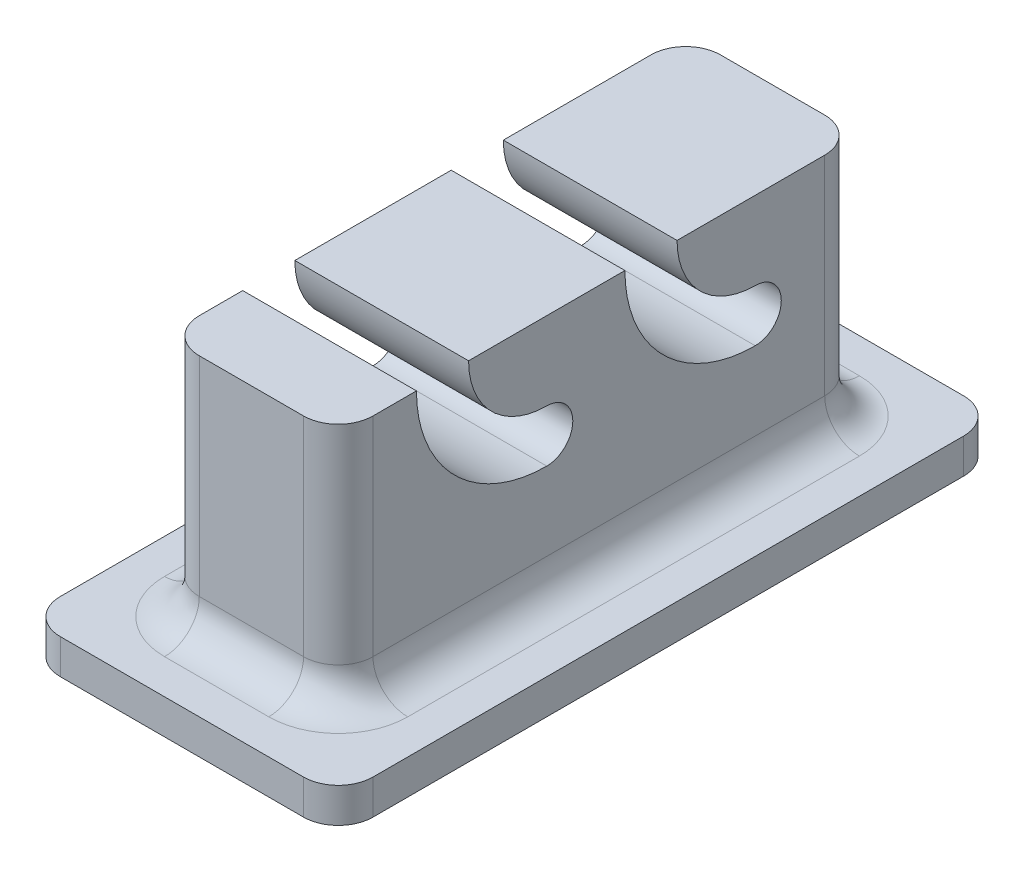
ISO-10303-21;
HEADER;
FILE_DESCRIPTION(('STEP AP214'),'2;1');
FILE_NAME('part.step','',(''),(''),'','','');
FILE_SCHEMA(('AUTOMOTIVE_DESIGN { 1 0 10303 214 1 1 1 1 }'));
ENDSEC;
DATA;
#1=APPLICATION_CONTEXT('core data for automotive mechanical design processes');
#2=APPLICATION_PROTOCOL_DEFINITION('international standard','automotive_design',2000,#1);
#3=PRODUCT_CONTEXT('',#1,'mechanical');
#4=PRODUCT('Part','Part','',(#3));
#5=PRODUCT_RELATED_PRODUCT_CATEGORY('part','',(#4));
#6=PRODUCT_DEFINITION_FORMATION('','',#4);
#7=PRODUCT_DEFINITION_CONTEXT('part definition',#1,'design');
#8=PRODUCT_DEFINITION('design','',#6,#7);
#9=PRODUCT_DEFINITION_SHAPE('','',#8);
#10=(LENGTH_UNIT() NAMED_UNIT(*) SI_UNIT(.MILLI.,.METRE.));
#11=(NAMED_UNIT(*) PLANE_ANGLE_UNIT() SI_UNIT($,.RADIAN.));
#12=(NAMED_UNIT(*) SI_UNIT($,.STERADIAN.) SOLID_ANGLE_UNIT());
#13=UNCERTAINTY_MEASURE_WITH_UNIT(LENGTH_MEASURE(1.E-05),#10,'distance_accuracy_value','');
#14=(GEOMETRIC_REPRESENTATION_CONTEXT(3) GLOBAL_UNCERTAINTY_ASSIGNED_CONTEXT((#13)) GLOBAL_UNIT_ASSIGNED_CONTEXT((#10,
#11,#12)) REPRESENTATION_CONTEXT('',''));
#15=CARTESIAN_POINT('',(0.,0.,0.));
#16=DIRECTION('',(0.,0.,1.));
#17=DIRECTION('',(1.,0.,0.));
#18=AXIS2_PLACEMENT_3D('',#15,#16,#17);
#19=CARTESIAN_POINT('',(0.,2.,0.));
#20=DIRECTION('',(0.,-1.,0.));
#21=DIRECTION('',(0.,0.,-1.));
#22=AXIS2_PLACEMENT_3D('',#19,#20,#21);
#23=PLANE('',#22);
#24=DIRECTION('',(0.,0.,-1.));
#25=VECTOR('',#24,1.);
#26=CARTESIAN_POINT('',(-4.,2.,4.));
#27=LINE('',#26,#25);
#28=CARTESIAN_POINT('',(-4.,2.,2.));
#29=VERTEX_POINT('',#28);
#30=CARTESIAN_POINT('',(-4.00000000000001,2.,-32.));
#31=VERTEX_POINT('',#30);
#32=EDGE_CURVE('E289',#29,#31,#27,.T.);
#33=ORIENTED_EDGE('',*,*,#32,.F.);
#34=CARTESIAN_POINT('',(-2.,2.,2.));
#35=DIRECTION('',(0.,-1.,0.));
#36=DIRECTION('',(0.,0.,-1.));
#37=AXIS2_PLACEMENT_3D('',#34,#35,#36);
#38=CIRCLE('',#37,2.);
#39=CARTESIAN_POINT('',(-2.,2.,4.));
#40=VERTEX_POINT('',#39);
#41=EDGE_CURVE('E349',#29,#40,#38,.F.);
#42=ORIENTED_EDGE('',*,*,#41,.T.);
#43=DIRECTION('',(-1.,0.,0.));
#44=VECTOR('',#43,1.);
#45=CARTESIAN_POINT('',(14.,2.,4.));
#46=LINE('',#45,#44);
#47=CARTESIAN_POINT('',(12.,2.,4.));
#48=VERTEX_POINT('',#47);
#49=EDGE_CURVE('E286',#48,#40,#46,.T.);
#50=ORIENTED_EDGE('',*,*,#49,.F.);
#51=CARTESIAN_POINT('',(12.,2.,2.));
#52=DIRECTION('',(0.,-1.,0.));
#53=DIRECTION('',(0.,0.,-1.));
#54=AXIS2_PLACEMENT_3D('',#51,#52,#53);
#55=CIRCLE('',#54,2.);
#56=CARTESIAN_POINT('',(14.,2.,2.));
#57=VERTEX_POINT('',#56);
#58=EDGE_CURVE('E345',#48,#57,#55,.F.);
#59=ORIENTED_EDGE('',*,*,#58,.T.);
#60=DIRECTION('',(0.,0.,1.));
#61=VECTOR('',#60,1.);
#62=CARTESIAN_POINT('',(14.,2.,-34.));
#63=LINE('',#62,#61);
#64=CARTESIAN_POINT('',(14.,2.,-32.));
#65=VERTEX_POINT('',#64);
#66=EDGE_CURVE('E296',#65,#57,#63,.T.);
#67=ORIENTED_EDGE('',*,*,#66,.F.);
#68=CARTESIAN_POINT('',(12.,2.,-32.));
#69=DIRECTION('',(0.,-1.,0.));
#70=DIRECTION('',(0.,0.,-1.));
#71=AXIS2_PLACEMENT_3D('',#68,#69,#70);
#72=CIRCLE('',#71,2.);
#73=CARTESIAN_POINT('',(12.,2.,-34.));
#74=VERTEX_POINT('',#73);
#75=EDGE_CURVE('E343',#65,#74,#72,.F.);
#76=ORIENTED_EDGE('',*,*,#75,.T.);
#77=DIRECTION('',(1.,0.,0.));
#78=VECTOR('',#77,1.);
#79=CARTESIAN_POINT('',(-4.00000000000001,2.,-34.));
#80=LINE('',#79,#78);
#81=CARTESIAN_POINT('',(-2.00000000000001,2.,-34.));
#82=VERTEX_POINT('',#81);
#83=EDGE_CURVE('E293',#82,#74,#80,.T.);
#84=ORIENTED_EDGE('',*,*,#83,.F.);
#85=CARTESIAN_POINT('',(-2.00000000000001,2.,-32.));
#86=DIRECTION('',(0.,-1.,0.));
#87=DIRECTION('',(0.,0.,-1.));
#88=AXIS2_PLACEMENT_3D('',#85,#86,#87);
#89=CIRCLE('',#88,2.);
#90=EDGE_CURVE('E347',#82,#31,#89,.F.);
#91=ORIENTED_EDGE('',*,*,#90,.T.);
#92=EDGE_LOOP('',(#33,#42,#50,#59,#67,#76,#84,#91));
#93=FACE_BOUND('',#92,.T.);
#94=CARTESIAN_POINT('',(8.,2.,-2.));
#95=DIRECTION('',(0.,-1.,0.));
#96=DIRECTION('',(0.,0.,-1.));
#97=AXIS2_PLACEMENT_3D('',#94,#95,#96);
#98=CIRCLE('',#97,4.);
#99=CARTESIAN_POINT('',(8.,2.,2.));
#100=VERTEX_POINT('',#99);
#101=CARTESIAN_POINT('',(12.,2.,-2.));
#102=VERTEX_POINT('',#101);
#103=EDGE_CURVE('E340',#100,#102,#98,.F.);
#104=ORIENTED_EDGE('',*,*,#103,.F.);
#105=DIRECTION('',(-1.,0.,0.));
#106=VECTOR('',#105,1.);
#107=CARTESIAN_POINT('',(0.,2.,2.));
#108=LINE('',#107,#106);
#109=CARTESIAN_POINT('',(2.,2.,2.));
#110=VERTEX_POINT('',#109);
#111=EDGE_CURVE('E337',#100,#110,#108,.T.);
#112=ORIENTED_EDGE('',*,*,#111,.T.);
#113=CARTESIAN_POINT('',(2.,2.,-2.));
#114=DIRECTION('',(0.,-1.,0.));
#115=DIRECTION('',(0.,0.,-1.));
#116=AXIS2_PLACEMENT_3D('',#113,#114,#115);
#117=CIRCLE('',#116,4.);
#118=CARTESIAN_POINT('',(-2.,2.,-2.));
#119=VERTEX_POINT('',#118);
#120=EDGE_CURVE('E334',#119,#110,#117,.F.);
#121=ORIENTED_EDGE('',*,*,#120,.F.);
#122=DIRECTION('',(0.,0.,-1.));
#123=VECTOR('',#122,1.);
#124=CARTESIAN_POINT('',(-2.00000000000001,2.,-30.));
#125=LINE('',#124,#123);
#126=CARTESIAN_POINT('',(-2.,2.,-28.));
#127=VERTEX_POINT('',#126);
#128=EDGE_CURVE('E332',#119,#127,#125,.T.);
#129=ORIENTED_EDGE('',*,*,#128,.T.);
#130=CARTESIAN_POINT('',(2.,2.,-28.));
#131=DIRECTION('',(0.,-1.,0.));
#132=DIRECTION('',(0.,0.,-1.));
#133=AXIS2_PLACEMENT_3D('',#130,#131,#132);
#134=CIRCLE('',#133,4.);
#135=CARTESIAN_POINT('',(2.,2.,-32.));
#136=VERTEX_POINT('',#135);
#137=EDGE_CURVE('E329',#136,#127,#134,.F.);
#138=ORIENTED_EDGE('',*,*,#137,.F.);
#139=DIRECTION('',(1.,0.,0.));
#140=VECTOR('',#139,1.);
#141=CARTESIAN_POINT('',(9.99999999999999,2.,-32.));
#142=LINE('',#141,#140);
#143=CARTESIAN_POINT('',(7.99999999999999,2.,-32.));
#144=VERTEX_POINT('',#143);
#145=EDGE_CURVE('E325',#136,#144,#142,.T.);
#146=ORIENTED_EDGE('',*,*,#145,.T.);
#147=CARTESIAN_POINT('',(7.99999999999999,2.,-28.));
#148=DIRECTION('',(0.,-1.,0.));
#149=DIRECTION('',(0.,0.,-1.));
#150=AXIS2_PLACEMENT_3D('',#147,#148,#149);
#151=CIRCLE('',#150,4.);
#152=CARTESIAN_POINT('',(12.,2.,-28.));
#153=VERTEX_POINT('',#152);
#154=EDGE_CURVE('E322',#153,#144,#151,.F.);
#155=ORIENTED_EDGE('',*,*,#154,.F.);
#156=DIRECTION('',(0.,0.,1.));
#157=VECTOR('',#156,1.);
#158=CARTESIAN_POINT('',(12.,2.,0.));
#159=LINE('',#158,#157);
#160=EDGE_CURVE('E327',#153,#102,#159,.T.);
#161=ORIENTED_EDGE('',*,*,#160,.T.);
#162=EDGE_LOOP('',(#104,#112,#121,#129,#138,#146,#155,#161));
#163=FACE_BOUND('',#162,.T.);
#164=ADVANCED_FACE('F37',(#93,#163),#23,.F.);
#165=CARTESIAN_POINT('',(0.,16.,0.));
#166=DIRECTION('',(1.,0.,0.));
#167=DIRECTION('',(0.,0.,-1.));
#168=AXIS2_PLACEMENT_3D('',#165,#166,#167);
#169=PLANE('',#168);
#170=DIRECTION('',(0.,0.,-1.));
#171=VECTOR('',#170,1.);
#172=CARTESIAN_POINT('',(0.,4.,0.));
#173=LINE('',#172,#171);
#174=CARTESIAN_POINT('',(0.,4.,-28.));
#175=VERTEX_POINT('',#174);
#176=CARTESIAN_POINT('',(0.,4.,-2.));
#177=VERTEX_POINT('',#176);
#178=EDGE_CURVE('E378',#175,#177,#173,.F.);
#179=ORIENTED_EDGE('',*,*,#178,.T.);
#180=DIRECTION('',(0.,-1.,0.));
#181=VECTOR('',#180,1.);
#182=CARTESIAN_POINT('',(0.,16.,-2.));
#183=LINE('',#182,#181);
#184=CARTESIAN_POINT('',(0.,16.,-2.));
#185=VERTEX_POINT('',#184);
#186=EDGE_CURVE('E380',#177,#185,#183,.F.);
#187=ORIENTED_EDGE('',*,*,#186,.T.);
#188=DIRECTION('',(0.,0.,1.));
#189=VECTOR('',#188,1.);
#190=CARTESIAN_POINT('',(0.,16.,0.));
#191=LINE('',#190,#189);
#192=CARTESIAN_POINT('',(0.,16.,-4.5));
#193=VERTEX_POINT('',#192);
#194=EDGE_CURVE('E299',#193,#185,#191,.T.);
#195=ORIENTED_EDGE('',*,*,#194,.F.);
#196=CARTESIAN_POINT('',(0.,16.,-12.));
#197=DIRECTION('',(1.,0.,0.));
#198=DIRECTION('',(0.,0.,-1.));
#199=AXIS2_PLACEMENT_3D('',#196,#197,#198);
#200=CIRCLE('',#199,7.5);
#201=CARTESIAN_POINT('',(0.,8.5,-12.));
#202=VERTEX_POINT('',#201);
#203=EDGE_CURVE('E262',#202,#193,#200,.F.);
#204=ORIENTED_EDGE('',*,*,#203,.F.);
#205=CARTESIAN_POINT('',(0.,10.,-12.));
#206=DIRECTION('',(1.,0.,0.));
#207=DIRECTION('',(0.,0.,-1.));
#208=AXIS2_PLACEMENT_3D('',#205,#206,#207);
#209=CIRCLE('',#208,1.5);
#210=CARTESIAN_POINT('',(0.,11.5,-12.));
#211=VERTEX_POINT('',#210);
#212=EDGE_CURVE('E264',#202,#211,#209,.T.);
#213=ORIENTED_EDGE('',*,*,#212,.T.);
#214=CARTESIAN_POINT('',(0.,16.,-12.));
#215=DIRECTION('',(1.,0.,0.));
#216=DIRECTION('',(0.,0.,-1.));
#217=AXIS2_PLACEMENT_3D('',#214,#215,#216);
#218=CIRCLE('',#217,4.5);
#219=CARTESIAN_POINT('',(0.,16.,-7.5));
#220=VERTEX_POINT('',#219);
#221=EDGE_CURVE('E268',#211,#220,#218,.F.);
#222=ORIENTED_EDGE('',*,*,#221,.T.);
#223=CARTESIAN_POINT('',(0.,16.,-16.5));
#224=VERTEX_POINT('',#223);
#225=EDGE_CURVE('E245',#224,#220,#191,.T.);
#226=ORIENTED_EDGE('',*,*,#225,.F.);
#227=CARTESIAN_POINT('',(0.,16.,-24.));
#228=DIRECTION('',(1.,0.,0.));
#229=DIRECTION('',(0.,0.,-1.));
#230=AXIS2_PLACEMENT_3D('',#227,#228,#229);
#231=CIRCLE('',#230,7.5);
#232=CARTESIAN_POINT('',(0.,8.49999999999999,-24.));
#233=VERTEX_POINT('',#232);
#234=EDGE_CURVE('E224',#233,#224,#231,.F.);
#235=ORIENTED_EDGE('',*,*,#234,.F.);
#236=CARTESIAN_POINT('',(0.,10.,-24.));
#237=DIRECTION('',(1.,0.,0.));
#238=DIRECTION('',(0.,0.,-1.));
#239=AXIS2_PLACEMENT_3D('',#236,#237,#238);
#240=CIRCLE('',#239,1.5);
#241=CARTESIAN_POINT('',(0.,11.5,-24.));
#242=VERTEX_POINT('',#241);
#243=EDGE_CURVE('E235',#233,#242,#240,.T.);
#244=ORIENTED_EDGE('',*,*,#243,.T.);
#245=CARTESIAN_POINT('',(0.,16.,-24.));
#246=DIRECTION('',(1.,0.,0.));
#247=DIRECTION('',(0.,0.,-1.));
#248=AXIS2_PLACEMENT_3D('',#245,#246,#247);
#249=CIRCLE('',#248,4.5);
#250=CARTESIAN_POINT('',(0.,16.,-19.5));
#251=VERTEX_POINT('',#250);
#252=EDGE_CURVE('E232',#242,#251,#249,.F.);
#253=ORIENTED_EDGE('',*,*,#252,.T.);
#254=CARTESIAN_POINT('',(0.,16.,-28.));
#255=VERTEX_POINT('',#254);
#256=EDGE_CURVE('E310',#255,#251,#191,.T.);
#257=ORIENTED_EDGE('',*,*,#256,.F.);
#258=DIRECTION('',(0.,-1.,0.));
#259=VECTOR('',#258,1.);
#260=CARTESIAN_POINT('',(0.,16.,-28.));
#261=LINE('',#260,#259);
#262=EDGE_CURVE('E376',#255,#175,#261,.T.);
#263=ORIENTED_EDGE('',*,*,#262,.T.);
#264=EDGE_LOOP('',(#179,#187,#195,#204,#213,#222,#226,#235,#244,#253,#257,#263));
#265=FACE_BOUND('',#264,.T.);
#266=ADVANCED_FACE('F242',(#265),#169,.F.);
#267=CARTESIAN_POINT('',(10.,16.,0.));
#268=DIRECTION('',(-1.,0.,0.));
#269=DIRECTION('',(0.,0.,1.));
#270=AXIS2_PLACEMENT_3D('',#267,#268,#269);
#271=PLANE('',#270);
#272=DIRECTION('',(0.,0.,1.));
#273=VECTOR('',#272,1.);
#274=CARTESIAN_POINT('',(9.99999999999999,4.,-30.));
#275=LINE('',#274,#273);
#276=CARTESIAN_POINT('',(10.,4.,-2.));
#277=VERTEX_POINT('',#276);
#278=CARTESIAN_POINT('',(9.99999999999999,4.,-28.));
#279=VERTEX_POINT('',#278);
#280=EDGE_CURVE('E46',#277,#279,#275,.F.);
#281=ORIENTED_EDGE('',*,*,#280,.T.);
#282=DIRECTION('',(0.,-1.,0.));
#283=VECTOR('',#282,1.);
#284=CARTESIAN_POINT('',(9.99999999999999,16.,-28.));
#285=LINE('',#284,#283);
#286=CARTESIAN_POINT('',(9.99999999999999,16.,-28.));
#287=VERTEX_POINT('',#286);
#288=EDGE_CURVE('E11',#279,#287,#285,.F.);
#289=ORIENTED_EDGE('',*,*,#288,.T.);
#290=DIRECTION('',(0.,0.,-1.));
#291=VECTOR('',#290,1.);
#292=CARTESIAN_POINT('',(10.,16.,0.));
#293=LINE('',#292,#291);
#294=CARTESIAN_POINT('',(10.,16.,-19.5));
#295=VERTEX_POINT('',#294);
#296=EDGE_CURVE('E315',#295,#287,#293,.T.);
#297=ORIENTED_EDGE('',*,*,#296,.F.);
#298=CARTESIAN_POINT('',(10.,16.,-24.));
#299=DIRECTION('',(1.,0.,0.));
#300=DIRECTION('',(0.,0.,-1.));
#301=AXIS2_PLACEMENT_3D('',#298,#299,#300);
#302=CIRCLE('',#301,4.5);
#303=CARTESIAN_POINT('',(10.,11.5,-24.));
#304=VERTEX_POINT('',#303);
#305=EDGE_CURVE('E246',#304,#295,#302,.F.);
#306=ORIENTED_EDGE('',*,*,#305,.F.);
#307=CARTESIAN_POINT('',(10.,10.,-24.));
#308=DIRECTION('',(1.,0.,0.));
#309=DIRECTION('',(0.,0.,-1.));
#310=AXIS2_PLACEMENT_3D('',#307,#308,#309);
#311=CIRCLE('',#310,1.5);
#312=CARTESIAN_POINT('',(10.,8.49999999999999,-24.));
#313=VERTEX_POINT('',#312);
#314=EDGE_CURVE('E248',#313,#304,#311,.T.);
#315=ORIENTED_EDGE('',*,*,#314,.F.);
#316=CARTESIAN_POINT('',(10.,16.,-24.));
#317=DIRECTION('',(1.,0.,0.));
#318=DIRECTION('',(0.,0.,-1.));
#319=AXIS2_PLACEMENT_3D('',#316,#317,#318);
#320=CIRCLE('',#319,7.5);
#321=CARTESIAN_POINT('',(10.,16.,-16.5));
#322=VERTEX_POINT('',#321);
#323=EDGE_CURVE('E227',#313,#322,#320,.F.);
#324=ORIENTED_EDGE('',*,*,#323,.T.);
#325=CARTESIAN_POINT('',(10.,16.,-7.5));
#326=VERTEX_POINT('',#325);
#327=EDGE_CURVE('E319',#326,#322,#293,.T.);
#328=ORIENTED_EDGE('',*,*,#327,.F.);
#329=CARTESIAN_POINT('',(10.,16.,-12.));
#330=DIRECTION('',(1.,0.,0.));
#331=DIRECTION('',(0.,0.,-1.));
#332=AXIS2_PLACEMENT_3D('',#329,#330,#331);
#333=CIRCLE('',#332,4.5);
#334=CARTESIAN_POINT('',(10.,11.5,-12.));
#335=VERTEX_POINT('',#334);
#336=EDGE_CURVE('E265',#335,#326,#333,.F.);
#337=ORIENTED_EDGE('',*,*,#336,.F.);
#338=CARTESIAN_POINT('',(10.,10.,-12.));
#339=DIRECTION('',(1.,0.,0.));
#340=DIRECTION('',(0.,0.,-1.));
#341=AXIS2_PLACEMENT_3D('',#338,#339,#340);
#342=CIRCLE('',#341,1.5);
#343=CARTESIAN_POINT('',(10.,8.5,-12.));
#344=VERTEX_POINT('',#343);
#345=EDGE_CURVE('E274',#344,#335,#342,.T.);
#346=ORIENTED_EDGE('',*,*,#345,.F.);
#347=CARTESIAN_POINT('',(10.,16.,-12.));
#348=DIRECTION('',(1.,0.,0.));
#349=DIRECTION('',(0.,0.,-1.));
#350=AXIS2_PLACEMENT_3D('',#347,#348,#349);
#351=CIRCLE('',#350,7.5);
#352=CARTESIAN_POINT('',(10.,16.,-4.5));
#353=VERTEX_POINT('',#352);
#354=EDGE_CURVE('E271',#344,#353,#351,.F.);
#355=ORIENTED_EDGE('',*,*,#354,.T.);
#356=CARTESIAN_POINT('',(10.,16.,-2.));
#357=VERTEX_POINT('',#356);
#358=EDGE_CURVE('E316',#357,#353,#293,.T.);
#359=ORIENTED_EDGE('',*,*,#358,.F.);
#360=DIRECTION('',(0.,-1.,0.));
#361=VECTOR('',#360,1.);
#362=CARTESIAN_POINT('',(10.,16.,-2.));
#363=LINE('',#362,#361);
#364=EDGE_CURVE('E57',#357,#277,#363,.T.);
#365=ORIENTED_EDGE('',*,*,#364,.T.);
#366=EDGE_LOOP('',(#281,#289,#297,#306,#315,#324,#328,#337,#346,#355,#359,#365));
#367=FACE_BOUND('',#366,.T.);
#368=ADVANCED_FACE('F477',(#367),#271,.F.);
#369=CARTESIAN_POINT('',(0.,16.,0.));
#370=DIRECTION('',(0.,-1.,0.));
#371=DIRECTION('',(0.,0.,-1.));
#372=AXIS2_PLACEMENT_3D('',#369,#370,#371);
#373=PLANE('',#372);
#374=DIRECTION('',(1.,0.,0.));
#375=VECTOR('',#374,1.);
#376=CARTESIAN_POINT('',(0.,16.,-16.5));
#377=LINE('',#376,#375);
#378=EDGE_CURVE('E255',#224,#322,#377,.T.);
#379=ORIENTED_EDGE('',*,*,#378,.F.);
#380=ORIENTED_EDGE('',*,*,#225,.T.);
#381=DIRECTION('',(1.,0.,0.));
#382=VECTOR('',#381,1.);
#383=CARTESIAN_POINT('',(0.,16.,-7.5));
#384=LINE('',#383,#382);
#385=EDGE_CURVE('E280',#220,#326,#384,.T.);
#386=ORIENTED_EDGE('',*,*,#385,.T.);
#387=ORIENTED_EDGE('',*,*,#327,.T.);
#388=EDGE_LOOP('',(#379,#380,#386,#387));
#389=FACE_BOUND('',#388,.T.);
#390=ADVANCED_FACE('F481',(#389),#373,.F.);
#391=ORIENTED_EDGE('',*,*,#194,.T.);
#392=CARTESIAN_POINT('',(2.,16.,-2.));
#393=DIRECTION('',(0.,-1.,0.));
#394=DIRECTION('',(0.,0.,-1.));
#395=AXIS2_PLACEMENT_3D('',#392,#393,#394);
#396=CIRCLE('',#395,2.);
#397=CARTESIAN_POINT('',(2.,16.,0.));
#398=VERTEX_POINT('',#397);
#399=EDGE_CURVE('E384',#185,#398,#396,.F.);
#400=ORIENTED_EDGE('',*,*,#399,.T.);
#401=DIRECTION('',(1.,0.,0.));
#402=VECTOR('',#401,1.);
#403=CARTESIAN_POINT('',(0.,16.,0.));
#404=LINE('',#403,#402);
#405=CARTESIAN_POINT('',(8.,16.,0.));
#406=VERTEX_POINT('',#405);
#407=EDGE_CURVE('E312',#398,#406,#404,.T.);
#408=ORIENTED_EDGE('',*,*,#407,.T.);
#409=CARTESIAN_POINT('',(8.,16.,-2.));
#410=DIRECTION('',(0.,-1.,0.));
#411=DIRECTION('',(0.,0.,-1.));
#412=AXIS2_PLACEMENT_3D('',#409,#410,#411);
#413=CIRCLE('',#412,2.);
#414=EDGE_CURVE('E382',#406,#357,#413,.F.);
#415=ORIENTED_EDGE('',*,*,#414,.T.);
#416=ORIENTED_EDGE('',*,*,#358,.T.);
#417=DIRECTION('',(1.,0.,0.));
#418=VECTOR('',#417,1.);
#419=CARTESIAN_POINT('',(0.,16.,-4.5));
#420=LINE('',#419,#418);
#421=EDGE_CURVE('E253',#193,#353,#420,.T.);
#422=ORIENTED_EDGE('',*,*,#421,.F.);
#423=EDGE_LOOP('',(#391,#400,#408,#415,#416,#422));
#424=FACE_BOUND('',#423,.T.);
#425=ADVANCED_FACE('F524',(#424),#373,.F.);
#426=CARTESIAN_POINT('',(0.,16.,0.));
#427=DIRECTION('',(0.,0.,-1.));
#428=DIRECTION('',(-1.,0.,0.));
#429=AXIS2_PLACEMENT_3D('',#426,#427,#428);
#430=PLANE('',#429);
#431=ORIENTED_EDGE('',*,*,#407,.F.);
#432=DIRECTION('',(0.,-1.,0.));
#433=VECTOR('',#432,1.);
#434=CARTESIAN_POINT('',(2.,16.,0.));
#435=LINE('',#434,#433);
#436=CARTESIAN_POINT('',(2.,4.,0.));
#437=VERTEX_POINT('',#436);
#438=EDGE_CURVE('E356',#398,#437,#435,.T.);
#439=ORIENTED_EDGE('',*,*,#438,.T.);
#440=DIRECTION('',(-1.,0.,0.));
#441=VECTOR('',#440,1.);
#442=CARTESIAN_POINT('',(10.,4.,0.));
#443=LINE('',#442,#441);
#444=CARTESIAN_POINT('',(8.,4.,0.));
#445=VERTEX_POINT('',#444);
#446=EDGE_CURVE('E353',#437,#445,#443,.F.);
#447=ORIENTED_EDGE('',*,*,#446,.T.);
#448=DIRECTION('',(0.,-1.,0.));
#449=VECTOR('',#448,1.);
#450=CARTESIAN_POINT('',(8.,16.,0.));
#451=LINE('',#450,#449);
#452=EDGE_CURVE('E351',#445,#406,#451,.F.);
#453=ORIENTED_EDGE('',*,*,#452,.T.);
#454=EDGE_LOOP('',(#431,#439,#447,#453));
#455=FACE_BOUND('',#454,.T.);
#456=ADVANCED_FACE('F522',(#455),#430,.F.);
#457=CARTESIAN_POINT('',(0.,16.,-30.));
#458=DIRECTION('',(0.,0.,1.));
#459=DIRECTION('',(1.,0.,0.));
#460=AXIS2_PLACEMENT_3D('',#457,#458,#459);
#461=PLANE('',#460);
#462=DIRECTION('',(1.,0.,0.));
#463=VECTOR('',#462,1.);
#464=CARTESIAN_POINT('',(0.,4.,-30.));
#465=LINE('',#464,#463);
#466=CARTESIAN_POINT('',(7.99999999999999,4.,-30.));
#467=VERTEX_POINT('',#466);
#468=CARTESIAN_POINT('',(2.,4.,-30.));
#469=VERTEX_POINT('',#468);
#470=EDGE_CURVE('E388',#467,#469,#465,.F.);
#471=ORIENTED_EDGE('',*,*,#470,.T.);
#472=DIRECTION('',(0.,-1.,0.));
#473=VECTOR('',#472,1.);
#474=CARTESIAN_POINT('',(2.,16.,-30.));
#475=LINE('',#474,#473);
#476=CARTESIAN_POINT('',(2.,16.,-30.));
#477=VERTEX_POINT('',#476);
#478=EDGE_CURVE('E390',#469,#477,#475,.F.);
#479=ORIENTED_EDGE('',*,*,#478,.T.);
#480=DIRECTION('',(-1.,0.,0.));
#481=VECTOR('',#480,1.);
#482=CARTESIAN_POINT('',(0.,16.,-30.));
#483=LINE('',#482,#481);
#484=CARTESIAN_POINT('',(7.99999999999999,16.,-30.));
#485=VERTEX_POINT('',#484);
#486=EDGE_CURVE('E318',#485,#477,#483,.T.);
#487=ORIENTED_EDGE('',*,*,#486,.F.);
#488=DIRECTION('',(0.,-1.,0.));
#489=VECTOR('',#488,1.);
#490=CARTESIAN_POINT('',(7.99999999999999,16.,-30.));
#491=LINE('',#490,#489);
#492=EDGE_CURVE('E386',#485,#467,#491,.T.);
#493=ORIENTED_EDGE('',*,*,#492,.T.);
#494=EDGE_LOOP('',(#471,#479,#487,#493));
#495=FACE_BOUND('',#494,.T.);
#496=ADVANCED_FACE('F459',(#495),#461,.F.);
#497=ORIENTED_EDGE('',*,*,#486,.T.);
#498=CARTESIAN_POINT('',(2.,16.,-28.));
#499=DIRECTION('',(0.,-1.,0.));
#500=DIRECTION('',(0.,0.,-1.));
#501=AXIS2_PLACEMENT_3D('',#498,#499,#500);
#502=CIRCLE('',#501,2.);
#503=EDGE_CURVE('E394',#477,#255,#502,.F.);
#504=ORIENTED_EDGE('',*,*,#503,.T.);
#505=ORIENTED_EDGE('',*,*,#256,.T.);
#506=DIRECTION('',(1.,0.,0.));
#507=VECTOR('',#506,1.);
#508=CARTESIAN_POINT('',(0.,16.,-19.5));
#509=LINE('',#508,#507);
#510=EDGE_CURVE('E258',#251,#295,#509,.T.);
#511=ORIENTED_EDGE('',*,*,#510,.T.);
#512=ORIENTED_EDGE('',*,*,#296,.T.);
#513=CARTESIAN_POINT('',(7.99999999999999,16.,-28.));
#514=DIRECTION('',(0.,-1.,0.));
#515=DIRECTION('',(0.,0.,-1.));
#516=AXIS2_PLACEMENT_3D('',#513,#514,#515);
#517=CIRCLE('',#516,2.);
#518=EDGE_CURVE('E392',#287,#485,#517,.F.);
#519=ORIENTED_EDGE('',*,*,#518,.T.);
#520=EDGE_LOOP('',(#497,#504,#505,#511,#512,#519));
#521=FACE_BOUND('',#520,.T.);
#522=ADVANCED_FACE('F469',(#521),#373,.F.);
#523=CARTESIAN_POINT('',(14.,2.,4.));
#524=DIRECTION('',(0.,0.,1.));
#525=DIRECTION('',(1.,0.,0.));
#526=AXIS2_PLACEMENT_3D('',#523,#524,#525);
#527=PLANE('',#526);
#528=ORIENTED_EDGE('',*,*,#49,.T.);
#529=DIRECTION('',(0.,-1.,0.));
#530=VECTOR('',#529,1.);
#531=CARTESIAN_POINT('',(-2.,2.,4.));
#532=LINE('',#531,#530);
#533=CARTESIAN_POINT('',(-2.,0.,4.));
#534=VERTEX_POINT('',#533);
#535=EDGE_CURVE('E360',#40,#534,#532,.T.);
#536=ORIENTED_EDGE('',*,*,#535,.T.);
#537=DIRECTION('',(-1.,0.,0.));
#538=VECTOR('',#537,1.);
#539=CARTESIAN_POINT('',(14.,0.,4.));
#540=LINE('',#539,#538);
#541=CARTESIAN_POINT('',(12.,0.,4.));
#542=VERTEX_POINT('',#541);
#543=EDGE_CURVE('E257',#542,#534,#540,.T.);
#544=ORIENTED_EDGE('',*,*,#543,.F.);
#545=DIRECTION('',(0.,-1.,0.));
#546=VECTOR('',#545,1.);
#547=CARTESIAN_POINT('',(12.,2.,4.));
#548=LINE('',#547,#546);
#549=EDGE_CURVE('E358',#542,#48,#548,.F.);
#550=ORIENTED_EDGE('',*,*,#549,.T.);
#551=EDGE_LOOP('',(#528,#536,#544,#550));
#552=FACE_BOUND('',#551,.T.);
#553=ADVANCED_FACE('F536',(#552),#527,.T.);
#554=CARTESIAN_POINT('',(14.,2.,-34.));
#555=DIRECTION('',(1.,0.,0.));
#556=DIRECTION('',(0.,0.,-1.));
#557=AXIS2_PLACEMENT_3D('',#554,#555,#556);
#558=PLANE('',#557);
#559=ORIENTED_EDGE('',*,*,#66,.T.);
#560=DIRECTION('',(0.,-1.,0.));
#561=VECTOR('',#560,1.);
#562=CARTESIAN_POINT('',(14.,2.,2.));
#563=LINE('',#562,#561);
#564=CARTESIAN_POINT('',(14.,0.,2.));
#565=VERTEX_POINT('',#564);
#566=EDGE_CURVE('E403',#57,#565,#563,.T.);
#567=ORIENTED_EDGE('',*,*,#566,.T.);
#568=DIRECTION('',(0.,0.,1.));
#569=VECTOR('',#568,1.);
#570=CARTESIAN_POINT('',(14.,0.,-34.));
#571=LINE('',#570,#569);
#572=CARTESIAN_POINT('',(14.,0.,-32.));
#573=VERTEX_POINT('',#572);
#574=EDGE_CURVE('E290',#573,#565,#571,.T.);
#575=ORIENTED_EDGE('',*,*,#574,.F.);
#576=DIRECTION('',(0.,-1.,0.));
#577=VECTOR('',#576,1.);
#578=CARTESIAN_POINT('',(14.,2.,-32.));
#579=LINE('',#578,#577);
#580=EDGE_CURVE('E401',#573,#65,#579,.F.);
#581=ORIENTED_EDGE('',*,*,#580,.T.);
#582=EDGE_LOOP('',(#559,#567,#575,#581));
#583=FACE_BOUND('',#582,.T.);
#584=ADVANCED_FACE('F548',(#583),#558,.T.);
#585=CARTESIAN_POINT('',(-4.00000000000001,2.,-34.));
#586=DIRECTION('',(0.,0.,-1.));
#587=DIRECTION('',(-1.,0.,0.));
#588=AXIS2_PLACEMENT_3D('',#585,#586,#587);
#589=PLANE('',#588);
#590=DIRECTION('',(1.,0.,0.));
#591=VECTOR('',#590,1.);
#592=CARTESIAN_POINT('',(-4.00000000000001,0.,-34.));
#593=LINE('',#592,#591);
#594=CARTESIAN_POINT('',(-2.00000000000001,0.,-34.));
#595=VERTEX_POINT('',#594);
#596=CARTESIAN_POINT('',(12.,0.,-34.));
#597=VERTEX_POINT('',#596);
#598=EDGE_CURVE('E305',#595,#597,#593,.T.);
#599=ORIENTED_EDGE('',*,*,#598,.F.);
#600=DIRECTION('',(0.,-1.,0.));
#601=VECTOR('',#600,1.);
#602=CARTESIAN_POINT('',(-2.00000000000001,2.,-34.));
#603=LINE('',#602,#601);
#604=EDGE_CURVE('E399',#595,#82,#603,.F.);
#605=ORIENTED_EDGE('',*,*,#604,.T.);
#606=ORIENTED_EDGE('',*,*,#83,.T.);
#607=DIRECTION('',(0.,-1.,0.));
#608=VECTOR('',#607,1.);
#609=CARTESIAN_POINT('',(12.,2.,-34.));
#610=LINE('',#609,#608);
#611=EDGE_CURVE('E396',#74,#597,#610,.T.);
#612=ORIENTED_EDGE('',*,*,#611,.T.);
#613=EDGE_LOOP('',(#599,#605,#606,#612));
#614=FACE_BOUND('',#613,.T.);
#615=ADVANCED_FACE('F551',(#614),#589,.T.);
#616=CARTESIAN_POINT('',(-4.,2.,4.));
#617=DIRECTION('',(-1.,0.,0.));
#618=DIRECTION('',(0.,0.,1.));
#619=AXIS2_PLACEMENT_3D('',#616,#617,#618);
#620=PLANE('',#619);
#621=DIRECTION('',(0.,0.,-1.));
#622=VECTOR('',#621,1.);
#623=CARTESIAN_POINT('',(-4.,0.,4.));
#624=LINE('',#623,#622);
#625=CARTESIAN_POINT('',(-4.,0.,2.));
#626=VERTEX_POINT('',#625);
#627=CARTESIAN_POINT('',(-4.00000000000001,0.,-32.));
#628=VERTEX_POINT('',#627);
#629=EDGE_CURVE('E302',#626,#628,#624,.T.);
#630=ORIENTED_EDGE('',*,*,#629,.F.);
#631=DIRECTION('',(0.,-1.,0.));
#632=VECTOR('',#631,1.);
#633=CARTESIAN_POINT('',(-4.,2.,2.));
#634=LINE('',#633,#632);
#635=EDGE_CURVE('E374',#626,#29,#634,.F.);
#636=ORIENTED_EDGE('',*,*,#635,.T.);
#637=ORIENTED_EDGE('',*,*,#32,.T.);
#638=DIRECTION('',(0.,-1.,0.));
#639=VECTOR('',#638,1.);
#640=CARTESIAN_POINT('',(-4.00000000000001,2.,-32.));
#641=LINE('',#640,#639);
#642=EDGE_CURVE('E371',#31,#628,#641,.T.);
#643=ORIENTED_EDGE('',*,*,#642,.T.);
#644=EDGE_LOOP('',(#630,#636,#637,#643));
#645=FACE_BOUND('',#644,.T.);
#646=ADVANCED_FACE('F555',(#645),#620,.T.);
#647=CARTESIAN_POINT('',(0.,0.,0.));
#648=DIRECTION('',(0.,-1.,0.));
#649=DIRECTION('',(0.,0.,-1.));
#650=AXIS2_PLACEMENT_3D('',#647,#648,#649);
#651=PLANE('',#650);
#652=ORIENTED_EDGE('',*,*,#543,.T.);
#653=CARTESIAN_POINT('',(-2.,0.,2.));
#654=DIRECTION('',(0.,-1.,0.));
#655=DIRECTION('',(0.,0.,-1.));
#656=AXIS2_PLACEMENT_3D('',#653,#654,#655);
#657=CIRCLE('',#656,2.);
#658=EDGE_CURVE('E369',#534,#626,#657,.T.);
#659=ORIENTED_EDGE('',*,*,#658,.T.);
#660=ORIENTED_EDGE('',*,*,#629,.T.);
#661=CARTESIAN_POINT('',(-2.00000000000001,0.,-32.));
#662=DIRECTION('',(0.,-1.,0.));
#663=DIRECTION('',(0.,0.,-1.));
#664=AXIS2_PLACEMENT_3D('',#661,#662,#663);
#665=CIRCLE('',#664,2.);
#666=EDGE_CURVE('E367',#628,#595,#665,.T.);
#667=ORIENTED_EDGE('',*,*,#666,.T.);
#668=ORIENTED_EDGE('',*,*,#598,.T.);
#669=CARTESIAN_POINT('',(12.,0.,-32.));
#670=DIRECTION('',(0.,-1.,0.));
#671=DIRECTION('',(0.,0.,-1.));
#672=AXIS2_PLACEMENT_3D('',#669,#670,#671);
#673=CIRCLE('',#672,2.);
#674=EDGE_CURVE('E363',#597,#573,#673,.T.);
#675=ORIENTED_EDGE('',*,*,#674,.T.);
#676=ORIENTED_EDGE('',*,*,#574,.T.);
#677=CARTESIAN_POINT('',(12.,0.,2.));
#678=DIRECTION('',(0.,-1.,0.));
#679=DIRECTION('',(0.,0.,-1.));
#680=AXIS2_PLACEMENT_3D('',#677,#678,#679);
#681=CIRCLE('',#680,2.);
#682=EDGE_CURVE('E365',#565,#542,#681,.T.);
#683=ORIENTED_EDGE('',*,*,#682,.T.);
#684=EDGE_LOOP('',(#652,#659,#660,#667,#668,#675,#676,#683));
#685=FACE_BOUND('',#684,.T.);
#686=ADVANCED_FACE('F558',(#685),#651,.T.);
#687=CARTESIAN_POINT('',(0.,16.,-12.));
#688=DIRECTION('',(1.,0.,0.));
#689=DIRECTION('',(0.,0.,-1.));
#690=AXIS2_PLACEMENT_3D('',#687,#688,#689);
#691=CYLINDRICAL_SURFACE('',#690,7.5);
#692=ORIENTED_EDGE('',*,*,#354,.F.);
#693=DIRECTION('',(1.,0.,0.));
#694=VECTOR('',#693,1.);
#695=CARTESIAN_POINT('',(0.,8.5,-12.));
#696=LINE('',#695,#694);
#697=EDGE_CURVE('E270',#202,#344,#696,.T.);
#698=ORIENTED_EDGE('',*,*,#697,.F.);
#699=ORIENTED_EDGE('',*,*,#203,.T.);
#700=ORIENTED_EDGE('',*,*,#421,.T.);
#701=EDGE_LOOP('',(#692,#698,#699,#700));
#702=FACE_BOUND('',#701,.T.);
#703=ADVANCED_FACE('F493',(#702),#691,.F.);
#704=CARTESIAN_POINT('',(0.,16.,-12.));
#705=DIRECTION('',(1.,0.,0.));
#706=DIRECTION('',(0.,0.,-1.));
#707=AXIS2_PLACEMENT_3D('',#704,#705,#706);
#708=CYLINDRICAL_SURFACE('',#707,4.5);
#709=ORIENTED_EDGE('',*,*,#336,.T.);
#710=ORIENTED_EDGE('',*,*,#385,.F.);
#711=ORIENTED_EDGE('',*,*,#221,.F.);
#712=DIRECTION('',(1.,0.,0.));
#713=VECTOR('',#712,1.);
#714=CARTESIAN_POINT('',(0.,11.5,-12.));
#715=LINE('',#714,#713);
#716=EDGE_CURVE('E283',#211,#335,#715,.T.);
#717=ORIENTED_EDGE('',*,*,#716,.T.);
#718=EDGE_LOOP('',(#709,#710,#711,#717));
#719=FACE_BOUND('',#718,.T.);
#720=ADVANCED_FACE('F485',(#719),#708,.T.);
#721=CARTESIAN_POINT('',(0.,10.,-12.));
#722=DIRECTION('',(1.,0.,0.));
#723=DIRECTION('',(0.,0.,-1.));
#724=AXIS2_PLACEMENT_3D('',#721,#722,#723);
#725=CYLINDRICAL_SURFACE('',#724,1.5);
#726=ORIENTED_EDGE('',*,*,#345,.T.);
#727=ORIENTED_EDGE('',*,*,#716,.F.);
#728=ORIENTED_EDGE('',*,*,#212,.F.);
#729=ORIENTED_EDGE('',*,*,#697,.T.);
#730=EDGE_LOOP('',(#726,#727,#728,#729));
#731=FACE_BOUND('',#730,.T.);
#732=ADVANCED_FACE('F489',(#731),#725,.F.);
#733=CARTESIAN_POINT('',(0.,16.,-24.));
#734=DIRECTION('',(1.,0.,0.));
#735=DIRECTION('',(0.,0.,-1.));
#736=AXIS2_PLACEMENT_3D('',#733,#734,#735);
#737=CYLINDRICAL_SURFACE('',#736,7.5);
#738=ORIENTED_EDGE('',*,*,#323,.F.);
#739=DIRECTION('',(1.,0.,0.));
#740=VECTOR('',#739,1.);
#741=CARTESIAN_POINT('',(0.,8.49999999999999,-24.));
#742=LINE('',#741,#740);
#743=EDGE_CURVE('E220',#233,#313,#742,.T.);
#744=ORIENTED_EDGE('',*,*,#743,.F.);
#745=ORIENTED_EDGE('',*,*,#234,.T.);
#746=ORIENTED_EDGE('',*,*,#378,.T.);
#747=EDGE_LOOP('',(#738,#744,#745,#746));
#748=FACE_BOUND('',#747,.T.);
#749=ADVANCED_FACE('F222',(#748),#737,.F.);
#750=CARTESIAN_POINT('',(0.,16.,-24.));
#751=DIRECTION('',(1.,0.,0.));
#752=DIRECTION('',(0.,0.,-1.));
#753=AXIS2_PLACEMENT_3D('',#750,#751,#752);
#754=CYLINDRICAL_SURFACE('',#753,4.5);
#755=ORIENTED_EDGE('',*,*,#305,.T.);
#756=ORIENTED_EDGE('',*,*,#510,.F.);
#757=ORIENTED_EDGE('',*,*,#252,.F.);
#758=DIRECTION('',(1.,0.,0.));
#759=VECTOR('',#758,1.);
#760=CARTESIAN_POINT('',(0.,11.5,-24.));
#761=LINE('',#760,#759);
#762=EDGE_CURVE('E231',#242,#304,#761,.T.);
#763=ORIENTED_EDGE('',*,*,#762,.T.);
#764=EDGE_LOOP('',(#755,#756,#757,#763));
#765=FACE_BOUND('',#764,.T.);
#766=ADVANCED_FACE('F472',(#765),#754,.T.);
#767=CARTESIAN_POINT('',(0.,10.,-24.));
#768=DIRECTION('',(1.,0.,0.));
#769=DIRECTION('',(0.,0.,-1.));
#770=AXIS2_PLACEMENT_3D('',#767,#768,#769);
#771=CYLINDRICAL_SURFACE('',#770,1.5);
#772=ORIENTED_EDGE('',*,*,#314,.T.);
#773=ORIENTED_EDGE('',*,*,#762,.F.);
#774=ORIENTED_EDGE('',*,*,#243,.F.);
#775=ORIENTED_EDGE('',*,*,#743,.T.);
#776=EDGE_LOOP('',(#772,#773,#774,#775));
#777=FACE_BOUND('',#776,.T.);
#778=ADVANCED_FACE('F236',(#777),#771,.F.);
#779=CARTESIAN_POINT('',(7.99999999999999,16.,-28.));
#780=DIRECTION('',(0.,-1.,0.));
#781=DIRECTION('',(0.,0.,-1.));
#782=AXIS2_PLACEMENT_3D('',#779,#780,#781);
#783=CYLINDRICAL_SURFACE('',#782,2.);
#784=ORIENTED_EDGE('',*,*,#518,.F.);
#785=ORIENTED_EDGE('',*,*,#288,.F.);
#786=CARTESIAN_POINT('',(7.99999999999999,4.,-28.));
#787=DIRECTION('',(0.,-1.,0.));
#788=DIRECTION('',(0.,0.,-1.));
#789=AXIS2_PLACEMENT_3D('',#786,#787,#788);
#790=CIRCLE('',#789,2.);
#791=EDGE_CURVE('E41',#467,#279,#790,.T.);
#792=ORIENTED_EDGE('',*,*,#791,.F.);
#793=ORIENTED_EDGE('',*,*,#492,.F.);
#794=EDGE_LOOP('',(#784,#785,#792,#793));
#795=FACE_BOUND('',#794,.T.);
#796=ADVANCED_FACE('F600',(#795),#783,.T.);
#797=CARTESIAN_POINT('',(0.,4.,-32.));
#798=DIRECTION('',(-1.,0.,0.));
#799=DIRECTION('',(0.,0.,1.));
#800=AXIS2_PLACEMENT_3D('',#797,#798,#799);
#801=CYLINDRICAL_SURFACE('',#800,2.);
#802=CARTESIAN_POINT('',(2.,4.,-32.));
#803=DIRECTION('',(1.,0.,0.));
#804=DIRECTION('',(0.,0.,-1.));
#805=AXIS2_PLACEMENT_3D('',#802,#803,#804);
#806=CIRCLE('',#805,2.);
#807=EDGE_CURVE('E433',#469,#136,#806,.T.);
#808=ORIENTED_EDGE('',*,*,#807,.F.);
#809=ORIENTED_EDGE('',*,*,#470,.F.);
#810=CARTESIAN_POINT('',(7.99999999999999,4.,-32.));
#811=DIRECTION('',(-1.,0.,0.));
#812=DIRECTION('',(0.,0.,1.));
#813=AXIS2_PLACEMENT_3D('',#810,#811,#812);
#814=CIRCLE('',#813,2.);
#815=EDGE_CURVE('E435',#144,#467,#814,.T.);
#816=ORIENTED_EDGE('',*,*,#815,.F.);
#817=ORIENTED_EDGE('',*,*,#145,.F.);
#818=EDGE_LOOP('',(#808,#809,#816,#817));
#819=FACE_BOUND('',#818,.T.);
#820=ADVANCED_FACE('F456',(#819),#801,.F.);
#821=CARTESIAN_POINT('',(2.,16.,-28.));
#822=DIRECTION('',(0.,-1.,0.));
#823=DIRECTION('',(0.,0.,-1.));
#824=AXIS2_PLACEMENT_3D('',#821,#822,#823);
#825=CYLINDRICAL_SURFACE('',#824,2.);
#826=ORIENTED_EDGE('',*,*,#503,.F.);
#827=ORIENTED_EDGE('',*,*,#478,.F.);
#828=CARTESIAN_POINT('',(2.,4.,-28.));
#829=DIRECTION('',(0.,-1.,0.));
#830=DIRECTION('',(0.,0.,-1.));
#831=AXIS2_PLACEMENT_3D('',#828,#829,#830);
#832=CIRCLE('',#831,2.);
#833=EDGE_CURVE('E430',#175,#469,#832,.T.);
#834=ORIENTED_EDGE('',*,*,#833,.F.);
#835=ORIENTED_EDGE('',*,*,#262,.F.);
#836=EDGE_LOOP('',(#826,#827,#834,#835));
#837=FACE_BOUND('',#836,.T.);
#838=ADVANCED_FACE('F464',(#837),#825,.T.);
#839=CARTESIAN_POINT('',(7.99999999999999,4.,-28.));
#840=DIRECTION('',(0.,-1.,0.));
#841=DIRECTION('',(0.,0.,-1.));
#842=AXIS2_PLACEMENT_3D('',#839,#840,#841);
#843=TOROIDAL_SURFACE('',#842,4.,2.);
#844=ORIENTED_EDGE('',*,*,#815,.T.);
#845=ORIENTED_EDGE('',*,*,#791,.T.);
#846=CARTESIAN_POINT('',(12.,4.,-28.));
#847=DIRECTION('',(0.,0.,1.));
#848=DIRECTION('',(1.,0.,0.));
#849=AXIS2_PLACEMENT_3D('',#846,#847,#848);
#850=CIRCLE('',#849,2.);
#851=EDGE_CURVE('E427',#153,#279,#850,.F.);
#852=ORIENTED_EDGE('',*,*,#851,.F.);
#853=ORIENTED_EDGE('',*,*,#154,.T.);
#854=EDGE_LOOP('',(#844,#845,#852,#853));
#855=FACE_BOUND('',#854,.T.);
#856=ADVANCED_FACE('F442',(#855),#843,.F.);
#857=CARTESIAN_POINT('',(2.,4.,-28.));
#858=DIRECTION('',(0.,-1.,0.));
#859=DIRECTION('',(0.,0.,-1.));
#860=AXIS2_PLACEMENT_3D('',#857,#858,#859);
#861=TOROIDAL_SURFACE('',#860,4.,2.);
#862=ORIENTED_EDGE('',*,*,#807,.T.);
#863=ORIENTED_EDGE('',*,*,#137,.T.);
#864=CARTESIAN_POINT('',(-2.,4.,-28.));
#865=DIRECTION('',(0.,0.,1.));
#866=DIRECTION('',(1.,0.,0.));
#867=AXIS2_PLACEMENT_3D('',#864,#865,#866);
#868=CIRCLE('',#867,2.);
#869=EDGE_CURVE('E424',#175,#127,#868,.F.);
#870=ORIENTED_EDGE('',*,*,#869,.F.);
#871=ORIENTED_EDGE('',*,*,#833,.T.);
#872=EDGE_LOOP('',(#862,#863,#870,#871));
#873=FACE_BOUND('',#872,.T.);
#874=ADVANCED_FACE('F609',(#873),#861,.F.);
#875=CARTESIAN_POINT('',(8.,16.,-2.));
#876=DIRECTION('',(0.,-1.,0.));
#877=DIRECTION('',(0.,0.,-1.));
#878=AXIS2_PLACEMENT_3D('',#875,#876,#877);
#879=CYLINDRICAL_SURFACE('',#878,2.);
#880=ORIENTED_EDGE('',*,*,#414,.F.);
#881=ORIENTED_EDGE('',*,*,#452,.F.);
#882=CARTESIAN_POINT('',(8.,4.,-2.));
#883=DIRECTION('',(0.,-1.,0.));
#884=DIRECTION('',(0.,0.,-1.));
#885=AXIS2_PLACEMENT_3D('',#882,#883,#884);
#886=CIRCLE('',#885,2.);
#887=EDGE_CURVE('E421',#277,#445,#886,.T.);
#888=ORIENTED_EDGE('',*,*,#887,.F.);
#889=ORIENTED_EDGE('',*,*,#364,.F.);
#890=EDGE_LOOP('',(#880,#881,#888,#889));
#891=FACE_BOUND('',#890,.T.);
#892=ADVANCED_FACE('F498',(#891),#879,.T.);
#893=CARTESIAN_POINT('',(12.,4.,0.));
#894=DIRECTION('',(0.,0.,-1.));
#895=DIRECTION('',(-1.,0.,0.));
#896=AXIS2_PLACEMENT_3D('',#893,#894,#895);
#897=CYLINDRICAL_SURFACE('',#896,2.);
#898=ORIENTED_EDGE('',*,*,#851,.T.);
#899=ORIENTED_EDGE('',*,*,#280,.F.);
#900=CARTESIAN_POINT('',(12.,4.,-2.));
#901=DIRECTION('',(0.,0.,-1.));
#902=DIRECTION('',(-1.,0.,0.));
#903=AXIS2_PLACEMENT_3D('',#900,#901,#902);
#904=CIRCLE('',#903,2.);
#905=EDGE_CURVE('E418',#102,#277,#904,.T.);
#906=ORIENTED_EDGE('',*,*,#905,.F.);
#907=ORIENTED_EDGE('',*,*,#160,.F.);
#908=EDGE_LOOP('',(#898,#899,#906,#907));
#909=FACE_BOUND('',#908,.T.);
#910=ADVANCED_FACE('F447',(#909),#897,.F.);
#911=CARTESIAN_POINT('',(-2.,4.,0.));
#912=DIRECTION('',(0.,0.,1.));
#913=DIRECTION('',(1.,0.,0.));
#914=AXIS2_PLACEMENT_3D('',#911,#912,#913);
#915=CYLINDRICAL_SURFACE('',#914,2.);
#916=ORIENTED_EDGE('',*,*,#869,.T.);
#917=ORIENTED_EDGE('',*,*,#128,.F.);
#918=CARTESIAN_POINT('',(-2.,4.,-2.));
#919=DIRECTION('',(0.,0.,-1.));
#920=DIRECTION('',(-1.,0.,0.));
#921=AXIS2_PLACEMENT_3D('',#918,#919,#920);
#922=CIRCLE('',#921,2.);
#923=EDGE_CURVE('E415',#177,#119,#922,.T.);
#924=ORIENTED_EDGE('',*,*,#923,.F.);
#925=ORIENTED_EDGE('',*,*,#178,.F.);
#926=EDGE_LOOP('',(#916,#917,#924,#925));
#927=FACE_BOUND('',#926,.T.);
#928=ADVANCED_FACE('F511',(#927),#915,.F.);
#929=CARTESIAN_POINT('',(2.,16.,-2.));
#930=DIRECTION('',(0.,-1.,0.));
#931=DIRECTION('',(0.,0.,-1.));
#932=AXIS2_PLACEMENT_3D('',#929,#930,#931);
#933=CYLINDRICAL_SURFACE('',#932,2.);
#934=ORIENTED_EDGE('',*,*,#399,.F.);
#935=ORIENTED_EDGE('',*,*,#186,.F.);
#936=CARTESIAN_POINT('',(2.,4.,-2.));
#937=DIRECTION('',(0.,-1.,0.));
#938=DIRECTION('',(0.,0.,-1.));
#939=AXIS2_PLACEMENT_3D('',#936,#937,#938);
#940=CIRCLE('',#939,2.);
#941=EDGE_CURVE('E412',#437,#177,#940,.T.);
#942=ORIENTED_EDGE('',*,*,#941,.F.);
#943=ORIENTED_EDGE('',*,*,#438,.F.);
#944=EDGE_LOOP('',(#934,#935,#942,#943));
#945=FACE_BOUND('',#944,.T.);
#946=ADVANCED_FACE('F519',(#945),#933,.T.);
#947=CARTESIAN_POINT('',(8.,4.,-2.));
#948=DIRECTION('',(0.,-1.,0.));
#949=DIRECTION('',(0.,0.,-1.));
#950=AXIS2_PLACEMENT_3D('',#947,#948,#949);
#951=TOROIDAL_SURFACE('',#950,4.,2.);
#952=ORIENTED_EDGE('',*,*,#905,.T.);
#953=ORIENTED_EDGE('',*,*,#887,.T.);
#954=CARTESIAN_POINT('',(8.,4.,2.));
#955=DIRECTION('',(-1.,0.,0.));
#956=DIRECTION('',(0.,0.,1.));
#957=AXIS2_PLACEMENT_3D('',#954,#955,#956);
#958=CIRCLE('',#957,2.);
#959=EDGE_CURVE('E410',#100,#445,#958,.F.);
#960=ORIENTED_EDGE('',*,*,#959,.F.);
#961=ORIENTED_EDGE('',*,*,#103,.T.);
#962=EDGE_LOOP('',(#952,#953,#960,#961));
#963=FACE_BOUND('',#962,.T.);
#964=ADVANCED_FACE('F501',(#963),#951,.F.);
#965=CARTESIAN_POINT('',(2.,4.,-2.));
#966=DIRECTION('',(0.,-1.,0.));
#967=DIRECTION('',(0.,0.,-1.));
#968=AXIS2_PLACEMENT_3D('',#965,#966,#967);
#969=TOROIDAL_SURFACE('',#968,4.,2.);
#970=ORIENTED_EDGE('',*,*,#923,.T.);
#971=ORIENTED_EDGE('',*,*,#120,.T.);
#972=CARTESIAN_POINT('',(2.,4.,2.));
#973=DIRECTION('',(1.,0.,0.));
#974=DIRECTION('',(0.,0.,-1.));
#975=AXIS2_PLACEMENT_3D('',#972,#973,#974);
#976=CIRCLE('',#975,2.);
#977=EDGE_CURVE('E408',#437,#110,#976,.F.);
#978=ORIENTED_EDGE('',*,*,#977,.F.);
#979=ORIENTED_EDGE('',*,*,#941,.T.);
#980=EDGE_LOOP('',(#970,#971,#978,#979));
#981=FACE_BOUND('',#980,.T.);
#982=ADVANCED_FACE('F513',(#981),#969,.F.);
#983=CARTESIAN_POINT('',(0.,4.,2.));
#984=DIRECTION('',(1.,0.,0.));
#985=DIRECTION('',(0.,0.,-1.));
#986=AXIS2_PLACEMENT_3D('',#983,#984,#985);
#987=CYLINDRICAL_SURFACE('',#986,2.);
#988=ORIENTED_EDGE('',*,*,#959,.T.);
#989=ORIENTED_EDGE('',*,*,#446,.F.);
#990=ORIENTED_EDGE('',*,*,#977,.T.);
#991=ORIENTED_EDGE('',*,*,#111,.F.);
#992=EDGE_LOOP('',(#988,#989,#990,#991));
#993=FACE_BOUND('',#992,.T.);
#994=ADVANCED_FACE('F505',(#993),#987,.F.);
#995=CARTESIAN_POINT('',(-2.,2.,2.));
#996=DIRECTION('',(0.,-1.,0.));
#997=DIRECTION('',(0.,0.,-1.));
#998=AXIS2_PLACEMENT_3D('',#995,#996,#997);
#999=CYLINDRICAL_SURFACE('',#998,2.);
#1000=ORIENTED_EDGE('',*,*,#41,.F.);
#1001=ORIENTED_EDGE('',*,*,#635,.F.);
#1002=ORIENTED_EDGE('',*,*,#658,.F.);
#1003=ORIENTED_EDGE('',*,*,#535,.F.);
#1004=EDGE_LOOP('',(#1000,#1001,#1002,#1003));
#1005=FACE_BOUND('',#1004,.T.);
#1006=ADVANCED_FACE('F571',(#1005),#999,.T.);
#1007=CARTESIAN_POINT('',(-2.00000000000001,2.,-32.));
#1008=DIRECTION('',(0.,-1.,0.));
#1009=DIRECTION('',(0.,0.,-1.));
#1010=AXIS2_PLACEMENT_3D('',#1007,#1008,#1009);
#1011=CYLINDRICAL_SURFACE('',#1010,2.);
#1012=ORIENTED_EDGE('',*,*,#90,.F.);
#1013=ORIENTED_EDGE('',*,*,#604,.F.);
#1014=ORIENTED_EDGE('',*,*,#666,.F.);
#1015=ORIENTED_EDGE('',*,*,#642,.F.);
#1016=EDGE_LOOP('',(#1012,#1013,#1014,#1015));
#1017=FACE_BOUND('',#1016,.T.);
#1018=ADVANCED_FACE('F578',(#1017),#1011,.T.);
#1019=CARTESIAN_POINT('',(12.,2.,2.));
#1020=DIRECTION('',(0.,-1.,0.));
#1021=DIRECTION('',(0.,0.,-1.));
#1022=AXIS2_PLACEMENT_3D('',#1019,#1020,#1021);
#1023=CYLINDRICAL_SURFACE('',#1022,2.);
#1024=ORIENTED_EDGE('',*,*,#58,.F.);
#1025=ORIENTED_EDGE('',*,*,#549,.F.);
#1026=ORIENTED_EDGE('',*,*,#682,.F.);
#1027=ORIENTED_EDGE('',*,*,#566,.F.);
#1028=EDGE_LOOP('',(#1024,#1025,#1026,#1027));
#1029=FACE_BOUND('',#1028,.T.);
#1030=ADVANCED_FACE('F590',(#1029),#1023,.T.);
#1031=CARTESIAN_POINT('',(12.,2.,-32.));
#1032=DIRECTION('',(0.,-1.,0.));
#1033=DIRECTION('',(0.,0.,-1.));
#1034=AXIS2_PLACEMENT_3D('',#1031,#1032,#1033);
#1035=CYLINDRICAL_SURFACE('',#1034,2.);
#1036=ORIENTED_EDGE('',*,*,#75,.F.);
#1037=ORIENTED_EDGE('',*,*,#580,.F.);
#1038=ORIENTED_EDGE('',*,*,#674,.F.);
#1039=ORIENTED_EDGE('',*,*,#611,.F.);
#1040=EDGE_LOOP('',(#1036,#1037,#1038,#1039));
#1041=FACE_BOUND('',#1040,.T.);
#1042=ADVANCED_FACE('F39',(#1041),#1035,.T.);
#1043=CLOSED_SHELL('',(#164,#266,#368,#390,#425,#456,#496,#522,#553,#584,#615,#646,#686,#703,
#720,#732,#749,#766,#778,#796,#820,#838,#856,#874,#892,#910,#928,#946,#964,#982,#994,#1006,
#1018,#1030,#1042));
#1044=MANIFOLD_SOLID_BREP('B2',#1043);
#1045=ADVANCED_BREP_SHAPE_REPRESENTATION('',(#18,#1044),#14);
#1046=SHAPE_DEFINITION_REPRESENTATION(#9,#1045);
ENDSEC;
END-ISO-10303-21;
